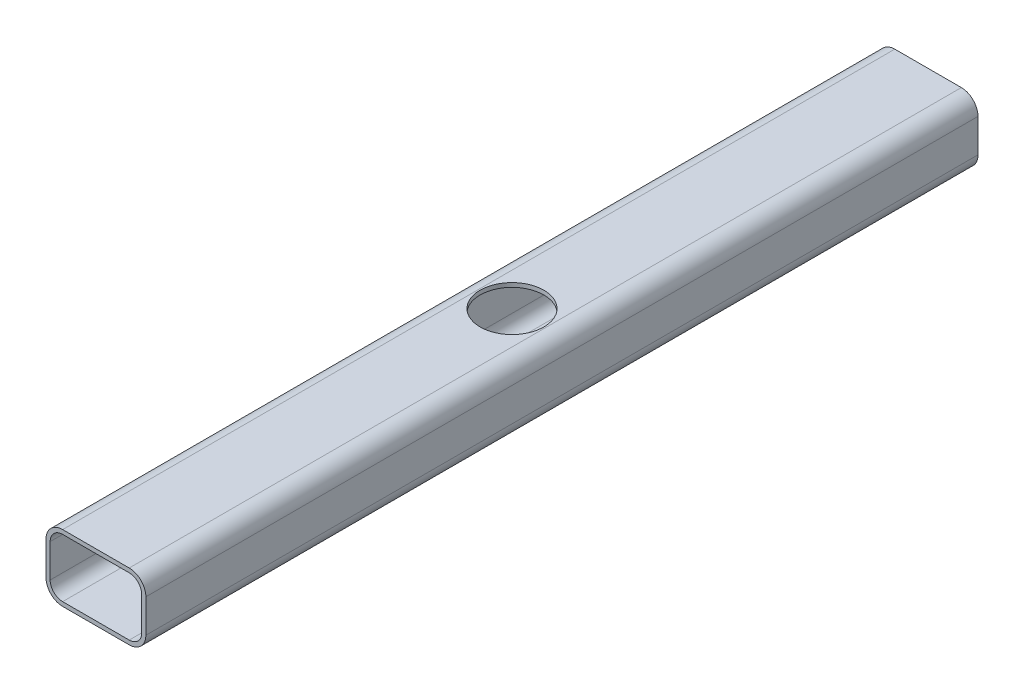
ISO-10303-21;
HEADER;
FILE_DESCRIPTION(('STEP AP214'),'2;1');
FILE_NAME('part.step','',(''),(''),'','','');
FILE_SCHEMA(('AUTOMOTIVE_DESIGN { 1 0 10303 214 1 1 1 1 }'));
ENDSEC;
DATA;
#1=APPLICATION_CONTEXT('core data for automotive mechanical design processes');
#2=APPLICATION_PROTOCOL_DEFINITION('international standard','automotive_design',2000,#1);
#3=PRODUCT_CONTEXT('',#1,'mechanical');
#4=PRODUCT('Part','Part','',(#3));
#5=PRODUCT_RELATED_PRODUCT_CATEGORY('part','',(#4));
#6=PRODUCT_DEFINITION_FORMATION('','',#4);
#7=PRODUCT_DEFINITION_CONTEXT('part definition',#1,'design');
#8=PRODUCT_DEFINITION('design','',#6,#7);
#9=PRODUCT_DEFINITION_SHAPE('','',#8);
#10=(LENGTH_UNIT() NAMED_UNIT(*) SI_UNIT(.MILLI.,.METRE.));
#11=(NAMED_UNIT(*) PLANE_ANGLE_UNIT() SI_UNIT($,.RADIAN.));
#12=(NAMED_UNIT(*) SI_UNIT($,.STERADIAN.) SOLID_ANGLE_UNIT());
#13=UNCERTAINTY_MEASURE_WITH_UNIT(LENGTH_MEASURE(1.E-05),#10,'distance_accuracy_value','');
#14=(GEOMETRIC_REPRESENTATION_CONTEXT(3) GLOBAL_UNCERTAINTY_ASSIGNED_CONTEXT((#13)) GLOBAL_UNIT_ASSIGNED_CONTEXT((#10,
#11,#12)) REPRESENTATION_CONTEXT('',''));
#15=CARTESIAN_POINT('',(0.,0.,0.));
#16=DIRECTION('',(0.,0.,1.));
#17=DIRECTION('',(1.,0.,0.));
#18=AXIS2_PLACEMENT_3D('',#15,#16,#17);
#19=CARTESIAN_POINT('',(25.3999999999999,-24.8599622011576,317.5));
#20=DIRECTION('',(0.,0.,1.));
#21=DIRECTION('',(1.,0.,0.));
#22=AXIS2_PLACEMENT_3D('',#19,#20,#21);
#23=PLANE('',#22);
#24=CARTESIAN_POINT('',(25.3999999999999,-24.8599622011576,317.5));
#25=DIRECTION('',(0.,0.,1.));
#26=DIRECTION('',(1.,0.,0.));
#27=AXIS2_PLACEMENT_3D('',#24,#25,#26);
#28=CIRCLE('',#27,12.7);
#29=CARTESIAN_POINT('',(25.3999999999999,-37.5599622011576,317.5));
#30=VERTEX_POINT('',#29);
#31=CARTESIAN_POINT('',(38.0999999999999,-24.8599622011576,317.5));
#32=VERTEX_POINT('',#31);
#33=EDGE_CURVE('E231',#30,#32,#28,.T.);
#34=ORIENTED_EDGE('',*,*,#33,.T.);
#35=DIRECTION('',(0.,-1.,0.));
#36=VECTOR('',#35,1.);
#37=CARTESIAN_POINT('',(38.0999999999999,0.540037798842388,317.5));
#38=LINE('',#37,#36);
#39=CARTESIAN_POINT('',(38.0999999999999,0.540037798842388,317.5));
#40=VERTEX_POINT('',#39);
#41=EDGE_CURVE('E233',#40,#32,#38,.T.);
#42=ORIENTED_EDGE('',*,*,#41,.F.);
#43=CARTESIAN_POINT('',(25.3999999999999,0.540037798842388,317.5));
#44=DIRECTION('',(0.,0.,1.));
#45=DIRECTION('',(1.,0.,0.));
#46=AXIS2_PLACEMENT_3D('',#43,#44,#45);
#47=CIRCLE('',#46,12.7);
#48=CARTESIAN_POINT('',(25.3999999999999,13.2400377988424,317.5));
#49=VERTEX_POINT('',#48);
#50=EDGE_CURVE('E236',#40,#49,#47,.T.);
#51=ORIENTED_EDGE('',*,*,#50,.T.);
#52=DIRECTION('',(-1.,0.,0.));
#53=VECTOR('',#52,1.);
#54=CARTESIAN_POINT('',(25.3999999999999,13.2400377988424,317.5));
#55=LINE('',#54,#53);
#56=CARTESIAN_POINT('',(-25.4000000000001,13.2400377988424,317.5));
#57=VERTEX_POINT('',#56);
#58=EDGE_CURVE('E238',#49,#57,#55,.T.);
#59=ORIENTED_EDGE('',*,*,#58,.T.);
#60=CARTESIAN_POINT('',(-25.4000000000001,0.540037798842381,317.5));
#61=DIRECTION('',(0.,0.,1.));
#62=DIRECTION('',(1.,0.,0.));
#63=AXIS2_PLACEMENT_3D('',#60,#61,#62);
#64=CIRCLE('',#63,12.7);
#65=CARTESIAN_POINT('',(-38.1000000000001,0.540037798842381,317.5));
#66=VERTEX_POINT('',#65);
#67=EDGE_CURVE('E240',#57,#66,#64,.T.);
#68=ORIENTED_EDGE('',*,*,#67,.T.);
#69=DIRECTION('',(0.,1.,0.));
#70=VECTOR('',#69,1.);
#71=CARTESIAN_POINT('',(-38.1000000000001,-24.8599622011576,317.5));
#72=LINE('',#71,#70);
#73=CARTESIAN_POINT('',(-38.1000000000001,-24.8599622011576,317.5));
#74=VERTEX_POINT('',#73);
#75=EDGE_CURVE('E242',#74,#66,#72,.T.);
#76=ORIENTED_EDGE('',*,*,#75,.F.);
#77=CARTESIAN_POINT('',(-25.4000000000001,-24.8599622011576,317.5));
#78=DIRECTION('',(0.,0.,1.));
#79=DIRECTION('',(1.,0.,0.));
#80=AXIS2_PLACEMENT_3D('',#77,#78,#79);
#81=CIRCLE('',#80,12.7);
#82=CARTESIAN_POINT('',(-25.4000000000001,-37.5599622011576,317.5));
#83=VERTEX_POINT('',#82);
#84=EDGE_CURVE('E245',#74,#83,#81,.T.);
#85=ORIENTED_EDGE('',*,*,#84,.T.);
#86=DIRECTION('',(1.,0.,0.));
#87=VECTOR('',#86,1.);
#88=CARTESIAN_POINT('',(-25.4000000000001,-37.5599622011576,317.5));
#89=LINE('',#88,#87);
#90=EDGE_CURVE('E247',#83,#30,#89,.T.);
#91=ORIENTED_EDGE('',*,*,#90,.T.);
#92=EDGE_LOOP('',(#34,#42,#51,#59,#68,#76,#85,#91));
#93=FACE_BOUND('',#92,.T.);
#94=DIRECTION('',(0.,-1.,0.));
#95=VECTOR('',#94,1.);
#96=CARTESIAN_POINT('',(34.9249999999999,0.540037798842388,317.5));
#97=LINE('',#96,#95);
#98=CARTESIAN_POINT('',(34.9249999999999,0.540037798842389,317.5));
#99=VERTEX_POINT('',#98);
#100=CARTESIAN_POINT('',(34.9249999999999,-24.8599622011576,317.5));
#101=VERTEX_POINT('',#100);
#102=EDGE_CURVE('E185',#99,#101,#97,.T.);
#103=ORIENTED_EDGE('',*,*,#102,.T.);
#104=CARTESIAN_POINT('',(25.3999999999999,-24.8599622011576,317.5));
#105=DIRECTION('',(0.,0.,1.));
#106=DIRECTION('',(1.,0.,0.));
#107=AXIS2_PLACEMENT_3D('',#104,#105,#106);
#108=CIRCLE('',#107,9.525);
#109=CARTESIAN_POINT('',(25.3999999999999,-34.3849622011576,317.5));
#110=VERTEX_POINT('',#109);
#111=EDGE_CURVE('E146',#110,#101,#108,.T.);
#112=ORIENTED_EDGE('',*,*,#111,.F.);
#113=DIRECTION('',(1.,0.,0.));
#114=VECTOR('',#113,1.);
#115=CARTESIAN_POINT('',(-25.4000000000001,-34.3849622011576,317.5));
#116=LINE('',#115,#114);
#117=CARTESIAN_POINT('',(-25.4000000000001,-34.3849622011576,317.5));
#118=VERTEX_POINT('',#117);
#119=EDGE_CURVE('E198',#118,#110,#116,.T.);
#120=ORIENTED_EDGE('',*,*,#119,.F.);
#121=CARTESIAN_POINT('',(-25.4000000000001,-24.8599622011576,317.5));
#122=DIRECTION('',(0.,0.,1.));
#123=DIRECTION('',(1.,0.,0.));
#124=AXIS2_PLACEMENT_3D('',#121,#122,#123);
#125=CIRCLE('',#124,9.525);
#126=CARTESIAN_POINT('',(-34.9250000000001,-24.8599622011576,317.5));
#127=VERTEX_POINT('',#126);
#128=EDGE_CURVE('E196',#127,#118,#125,.T.);
#129=ORIENTED_EDGE('',*,*,#128,.F.);
#130=DIRECTION('',(0.,1.,0.));
#131=VECTOR('',#130,1.);
#132=CARTESIAN_POINT('',(-34.9250000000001,-24.8599622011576,317.5));
#133=LINE('',#132,#131);
#134=CARTESIAN_POINT('',(-34.9250000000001,0.540037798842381,317.5));
#135=VERTEX_POINT('',#134);
#136=EDGE_CURVE('E193',#127,#135,#133,.T.);
#137=ORIENTED_EDGE('',*,*,#136,.T.);
#138=CARTESIAN_POINT('',(-25.4000000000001,0.540037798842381,317.5));
#139=DIRECTION('',(0.,0.,1.));
#140=DIRECTION('',(1.,0.,0.));
#141=AXIS2_PLACEMENT_3D('',#138,#139,#140);
#142=CIRCLE('',#141,9.525);
#143=CARTESIAN_POINT('',(-25.4000000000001,10.0650377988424,317.5));
#144=VERTEX_POINT('',#143);
#145=EDGE_CURVE('E191',#144,#135,#142,.T.);
#146=ORIENTED_EDGE('',*,*,#145,.F.);
#147=DIRECTION('',(-1.,0.,0.));
#148=VECTOR('',#147,1.);
#149=CARTESIAN_POINT('',(25.3999999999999,10.0650377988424,317.5));
#150=LINE('',#149,#148);
#151=CARTESIAN_POINT('',(25.3999999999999,10.0650377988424,317.5));
#152=VERTEX_POINT('',#151);
#153=EDGE_CURVE('E189',#152,#144,#150,.T.);
#154=ORIENTED_EDGE('',*,*,#153,.F.);
#155=CARTESIAN_POINT('',(25.3999999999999,0.540037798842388,317.5));
#156=DIRECTION('',(0.,0.,1.));
#157=DIRECTION('',(1.,0.,0.));
#158=AXIS2_PLACEMENT_3D('',#155,#156,#157);
#159=CIRCLE('',#158,9.525);
#160=EDGE_CURVE('E187',#99,#152,#159,.T.);
#161=ORIENTED_EDGE('',*,*,#160,.F.);
#162=EDGE_LOOP('',(#103,#112,#120,#129,#137,#146,#154,#161));
#163=FACE_BOUND('',#162,.T.);
#164=ADVANCED_FACE('F30',(#93,#163),#23,.T.);
#165=CARTESIAN_POINT('',(25.3999999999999,-24.8599622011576,-317.5));
#166=DIRECTION('',(0.,0.,1.));
#167=DIRECTION('',(1.,0.,0.));
#168=AXIS2_PLACEMENT_3D('',#165,#166,#167);
#169=PLANE('',#168);
#170=CARTESIAN_POINT('',(25.3999999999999,-24.8599622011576,-317.5));
#171=DIRECTION('',(0.,0.,1.));
#172=DIRECTION('',(1.,0.,0.));
#173=AXIS2_PLACEMENT_3D('',#170,#171,#172);
#174=CIRCLE('',#173,12.7);
#175=CARTESIAN_POINT('',(25.3999999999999,-37.5599622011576,-317.5));
#176=VERTEX_POINT('',#175);
#177=CARTESIAN_POINT('',(38.0999999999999,-24.8599622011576,-317.5));
#178=VERTEX_POINT('',#177);
#179=EDGE_CURVE('E150',#176,#178,#174,.T.);
#180=ORIENTED_EDGE('',*,*,#179,.F.);
#181=DIRECTION('',(1.,0.,0.));
#182=VECTOR('',#181,1.);
#183=CARTESIAN_POINT('',(-25.4000000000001,-37.5599622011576,-317.5));
#184=LINE('',#183,#182);
#185=CARTESIAN_POINT('',(-25.4000000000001,-37.5599622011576,-317.5));
#186=VERTEX_POINT('',#185);
#187=EDGE_CURVE('E229',#186,#176,#184,.T.);
#188=ORIENTED_EDGE('',*,*,#187,.F.);
#189=CARTESIAN_POINT('',(-25.4000000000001,-24.8599622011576,-317.5));
#190=DIRECTION('',(0.,0.,1.));
#191=DIRECTION('',(1.,0.,0.));
#192=AXIS2_PLACEMENT_3D('',#189,#190,#191);
#193=CIRCLE('',#192,12.7);
#194=CARTESIAN_POINT('',(-38.1000000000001,-24.8599622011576,-317.5));
#195=VERTEX_POINT('',#194);
#196=EDGE_CURVE('E227',#195,#186,#193,.T.);
#197=ORIENTED_EDGE('',*,*,#196,.F.);
#198=DIRECTION('',(0.,1.,0.));
#199=VECTOR('',#198,1.);
#200=CARTESIAN_POINT('',(-38.1000000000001,-24.8599622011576,-317.5));
#201=LINE('',#200,#199);
#202=CARTESIAN_POINT('',(-38.1000000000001,0.540037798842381,-317.5));
#203=VERTEX_POINT('',#202);
#204=EDGE_CURVE('E224',#195,#203,#201,.T.);
#205=ORIENTED_EDGE('',*,*,#204,.T.);
#206=CARTESIAN_POINT('',(-25.4000000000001,0.540037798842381,-317.5));
#207=DIRECTION('',(0.,0.,1.));
#208=DIRECTION('',(1.,0.,0.));
#209=AXIS2_PLACEMENT_3D('',#206,#207,#208);
#210=CIRCLE('',#209,12.7);
#211=CARTESIAN_POINT('',(-25.4000000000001,13.2400377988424,-317.5));
#212=VERTEX_POINT('',#211);
#213=EDGE_CURVE('E221',#212,#203,#210,.T.);
#214=ORIENTED_EDGE('',*,*,#213,.F.);
#215=DIRECTION('',(-1.,0.,0.));
#216=VECTOR('',#215,1.);
#217=CARTESIAN_POINT('',(25.3999999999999,13.2400377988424,-317.5));
#218=LINE('',#217,#216);
#219=CARTESIAN_POINT('',(25.3999999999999,13.2400377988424,-317.5));
#220=VERTEX_POINT('',#219);
#221=EDGE_CURVE('E219',#220,#212,#218,.T.);
#222=ORIENTED_EDGE('',*,*,#221,.F.);
#223=CARTESIAN_POINT('',(25.3999999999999,0.540037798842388,-317.5));
#224=DIRECTION('',(0.,0.,1.));
#225=DIRECTION('',(1.,0.,0.));
#226=AXIS2_PLACEMENT_3D('',#223,#224,#225);
#227=CIRCLE('',#226,12.7);
#228=CARTESIAN_POINT('',(38.0999999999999,0.540037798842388,-317.5));
#229=VERTEX_POINT('',#228);
#230=EDGE_CURVE('E217',#229,#220,#227,.T.);
#231=ORIENTED_EDGE('',*,*,#230,.F.);
#232=DIRECTION('',(0.,-1.,0.));
#233=VECTOR('',#232,1.);
#234=CARTESIAN_POINT('',(38.0999999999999,0.540037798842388,-317.5));
#235=LINE('',#234,#233);
#236=EDGE_CURVE('E214',#229,#178,#235,.T.);
#237=ORIENTED_EDGE('',*,*,#236,.T.);
#238=EDGE_LOOP('',(#180,#188,#197,#205,#214,#222,#231,#237));
#239=FACE_BOUND('',#238,.T.);
#240=CARTESIAN_POINT('',(25.3999999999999,-24.8599622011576,-317.5));
#241=DIRECTION('',(0.,0.,1.));
#242=DIRECTION('',(1.,0.,0.));
#243=AXIS2_PLACEMENT_3D('',#240,#241,#242);
#244=CIRCLE('',#243,9.525);
#245=CARTESIAN_POINT('',(25.3999999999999,-34.3849622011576,-317.5));
#246=VERTEX_POINT('',#245);
#247=CARTESIAN_POINT('',(34.9249999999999,-24.8599622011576,-317.5));
#248=VERTEX_POINT('',#247);
#249=EDGE_CURVE('E54',#246,#248,#244,.T.);
#250=ORIENTED_EDGE('',*,*,#249,.T.);
#251=DIRECTION('',(0.,-1.,0.));
#252=VECTOR('',#251,1.);
#253=CARTESIAN_POINT('',(34.9249999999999,0.540037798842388,-317.5));
#254=LINE('',#253,#252);
#255=CARTESIAN_POINT('',(34.9249999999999,0.540037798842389,-317.5));
#256=VERTEX_POINT('',#255);
#257=EDGE_CURVE('E154',#256,#248,#254,.T.);
#258=ORIENTED_EDGE('',*,*,#257,.F.);
#259=CARTESIAN_POINT('',(25.3999999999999,0.540037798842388,-317.5));
#260=DIRECTION('',(0.,0.,1.));
#261=DIRECTION('',(1.,0.,0.));
#262=AXIS2_PLACEMENT_3D('',#259,#260,#261);
#263=CIRCLE('',#262,9.525);
#264=CARTESIAN_POINT('',(25.3999999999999,10.0650377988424,-317.5));
#265=VERTEX_POINT('',#264);
#266=EDGE_CURVE('E159',#256,#265,#263,.T.);
#267=ORIENTED_EDGE('',*,*,#266,.T.);
#268=DIRECTION('',(-1.,0.,0.));
#269=VECTOR('',#268,1.);
#270=CARTESIAN_POINT('',(25.3999999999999,10.0650377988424,-317.5));
#271=LINE('',#270,#269);
#272=CARTESIAN_POINT('',(-25.4000000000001,10.0650377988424,-317.5));
#273=VERTEX_POINT('',#272);
#274=EDGE_CURVE('E172',#265,#273,#271,.T.);
#275=ORIENTED_EDGE('',*,*,#274,.T.);
#276=CARTESIAN_POINT('',(-25.4000000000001,0.540037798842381,-317.5));
#277=DIRECTION('',(0.,0.,1.));
#278=DIRECTION('',(1.,0.,0.));
#279=AXIS2_PLACEMENT_3D('',#276,#277,#278);
#280=CIRCLE('',#279,9.525);
#281=CARTESIAN_POINT('',(-34.9250000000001,0.540037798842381,-317.5));
#282=VERTEX_POINT('',#281);
#283=EDGE_CURVE('E175',#273,#282,#280,.T.);
#284=ORIENTED_EDGE('',*,*,#283,.T.);
#285=DIRECTION('',(0.,1.,0.));
#286=VECTOR('',#285,1.);
#287=CARTESIAN_POINT('',(-34.9250000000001,-24.8599622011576,-317.5));
#288=LINE('',#287,#286);
#289=CARTESIAN_POINT('',(-34.9250000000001,-24.8599622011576,-317.5));
#290=VERTEX_POINT('',#289);
#291=EDGE_CURVE('E178',#290,#282,#288,.T.);
#292=ORIENTED_EDGE('',*,*,#291,.F.);
#293=CARTESIAN_POINT('',(-25.4000000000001,-24.8599622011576,-317.5));
#294=DIRECTION('',(0.,0.,1.));
#295=DIRECTION('',(1.,0.,0.));
#296=AXIS2_PLACEMENT_3D('',#293,#294,#295);
#297=CIRCLE('',#296,9.525);
#298=CARTESIAN_POINT('',(-25.4000000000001,-34.3849622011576,-317.5));
#299=VERTEX_POINT('',#298);
#300=EDGE_CURVE('E181',#290,#299,#297,.T.);
#301=ORIENTED_EDGE('',*,*,#300,.T.);
#302=DIRECTION('',(1.,0.,0.));
#303=VECTOR('',#302,1.);
#304=CARTESIAN_POINT('',(-25.4000000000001,-34.3849622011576,-317.5));
#305=LINE('',#304,#303);
#306=EDGE_CURVE('E164',#299,#246,#305,.T.);
#307=ORIENTED_EDGE('',*,*,#306,.T.);
#308=EDGE_LOOP('',(#250,#258,#267,#275,#284,#292,#301,#307));
#309=FACE_BOUND('',#308,.T.);
#310=ADVANCED_FACE('F162',(#239,#309),#169,.F.);
#311=CARTESIAN_POINT('',(25.3999999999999,-24.8599622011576,317.5));
#312=DIRECTION('',(0.,0.,-1.));
#313=DIRECTION('',(-1.,0.,0.));
#314=AXIS2_PLACEMENT_3D('',#311,#312,#313);
#315=CYLINDRICAL_SURFACE('',#314,12.7);
#316=ORIENTED_EDGE('',*,*,#179,.T.);
#317=DIRECTION('',(0.,0.,-1.));
#318=VECTOR('',#317,1.);
#319=CARTESIAN_POINT('',(38.0999999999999,-24.8599622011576,317.5));
#320=LINE('',#319,#318);
#321=EDGE_CURVE('E11',#32,#178,#320,.T.);
#322=ORIENTED_EDGE('',*,*,#321,.F.);
#323=ORIENTED_EDGE('',*,*,#33,.F.);
#324=DIRECTION('',(0.,0.,-1.));
#325=VECTOR('',#324,1.);
#326=CARTESIAN_POINT('',(25.3999999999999,-37.5599622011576,317.5));
#327=LINE('',#326,#325);
#328=EDGE_CURVE('E249',#30,#176,#327,.T.);
#329=ORIENTED_EDGE('',*,*,#328,.T.);
#330=EDGE_LOOP('',(#316,#322,#323,#329));
#331=FACE_BOUND('',#330,.T.);
#332=ADVANCED_FACE('F32',(#331),#315,.T.);
#333=CARTESIAN_POINT('',(38.0999999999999,0.540037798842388,317.5));
#334=DIRECTION('',(1.,0.,0.));
#335=DIRECTION('',(0.,0.,-1.));
#336=AXIS2_PLACEMENT_3D('',#333,#334,#335);
#337=PLANE('',#336);
#338=ORIENTED_EDGE('',*,*,#236,.F.);
#339=DIRECTION('',(0.,0.,-1.));
#340=VECTOR('',#339,1.);
#341=CARTESIAN_POINT('',(38.0999999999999,0.540037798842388,317.5));
#342=LINE('',#341,#340);
#343=EDGE_CURVE('E39',#40,#229,#342,.T.);
#344=ORIENTED_EDGE('',*,*,#343,.F.);
#345=ORIENTED_EDGE('',*,*,#41,.T.);
#346=ORIENTED_EDGE('',*,*,#321,.T.);
#347=EDGE_LOOP('',(#338,#344,#345,#346));
#348=FACE_BOUND('',#347,.T.);
#349=ADVANCED_FACE('F277',(#348),#337,.T.);
#350=CARTESIAN_POINT('',(25.3999999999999,0.540037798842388,317.5));
#351=DIRECTION('',(0.,0.,-1.));
#352=DIRECTION('',(-1.,0.,0.));
#353=AXIS2_PLACEMENT_3D('',#350,#351,#352);
#354=CYLINDRICAL_SURFACE('',#353,12.7);
#355=ORIENTED_EDGE('',*,*,#230,.T.);
#356=DIRECTION('',(0.,0.,-1.));
#357=VECTOR('',#356,1.);
#358=CARTESIAN_POINT('',(25.3999999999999,13.2400377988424,317.5));
#359=LINE('',#358,#357);
#360=EDGE_CURVE('E262',#49,#220,#359,.T.);
#361=ORIENTED_EDGE('',*,*,#360,.F.);
#362=ORIENTED_EDGE('',*,*,#50,.F.);
#363=ORIENTED_EDGE('',*,*,#343,.T.);
#364=EDGE_LOOP('',(#355,#361,#362,#363));
#365=FACE_BOUND('',#364,.T.);
#366=ADVANCED_FACE('F268',(#365),#354,.T.);
#367=CARTESIAN_POINT('',(25.3999999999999,13.2400377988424,317.5));
#368=DIRECTION('',(0.,-1.,0.));
#369=DIRECTION('',(1.,0.,0.));
#370=AXIS2_PLACEMENT_3D('',#367,#368,#369);
#371=PLANE('',#370);
#372=CARTESIAN_POINT('',(0.,13.2400377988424,0.));
#373=DIRECTION('',(0.,1.,0.));
#374=DIRECTION('',(-1.,0.,0.));
#375=AXIS2_PLACEMENT_3D('',#372,#373,#374);
#376=CIRCLE('',#375,24.3219009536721);
#377=CARTESIAN_POINT('',(-24.3219009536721,13.2400377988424,0.));
#378=VERTEX_POINT('',#377);
#379=EDGE_CURVE('E486',#378,#378,#376,.T.);
#380=ORIENTED_EDGE('',*,*,#379,.F.);
#381=EDGE_LOOP('',(#380));
#382=FACE_BOUND('',#381,.T.);
#383=ORIENTED_EDGE('',*,*,#221,.T.);
#384=DIRECTION('',(0.,0.,-1.));
#385=VECTOR('',#384,1.);
#386=CARTESIAN_POINT('',(-25.4000000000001,13.2400377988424,317.5));
#387=LINE('',#386,#385);
#388=EDGE_CURVE('E259',#57,#212,#387,.T.);
#389=ORIENTED_EDGE('',*,*,#388,.F.);
#390=ORIENTED_EDGE('',*,*,#58,.F.);
#391=ORIENTED_EDGE('',*,*,#360,.T.);
#392=EDGE_LOOP('',(#383,#389,#390,#391));
#393=FACE_BOUND('',#392,.T.);
#394=ADVANCED_FACE('F302',(#382,#393),#371,.F.);
#395=CARTESIAN_POINT('',(-25.4000000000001,0.540037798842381,317.5));
#396=DIRECTION('',(0.,0.,-1.));
#397=DIRECTION('',(-1.,0.,0.));
#398=AXIS2_PLACEMENT_3D('',#395,#396,#397);
#399=CYLINDRICAL_SURFACE('',#398,12.7);
#400=ORIENTED_EDGE('',*,*,#213,.T.);
#401=DIRECTION('',(0.,0.,-1.));
#402=VECTOR('',#401,1.);
#403=CARTESIAN_POINT('',(-38.1000000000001,0.540037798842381,317.5));
#404=LINE('',#403,#402);
#405=EDGE_CURVE('E257',#66,#203,#404,.T.);
#406=ORIENTED_EDGE('',*,*,#405,.F.);
#407=ORIENTED_EDGE('',*,*,#67,.F.);
#408=ORIENTED_EDGE('',*,*,#388,.T.);
#409=EDGE_LOOP('',(#400,#406,#407,#408));
#410=FACE_BOUND('',#409,.T.);
#411=ADVANCED_FACE('F297',(#410),#399,.T.);
#412=CARTESIAN_POINT('',(-38.1000000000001,-24.8599622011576,317.5));
#413=DIRECTION('',(-1.,0.,0.));
#414=DIRECTION('',(0.,0.,1.));
#415=AXIS2_PLACEMENT_3D('',#412,#413,#414);
#416=PLANE('',#415);
#417=ORIENTED_EDGE('',*,*,#204,.F.);
#418=DIRECTION('',(0.,0.,-1.));
#419=VECTOR('',#418,1.);
#420=CARTESIAN_POINT('',(-38.1000000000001,-24.8599622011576,317.5));
#421=LINE('',#420,#419);
#422=EDGE_CURVE('E255',#74,#195,#421,.T.);
#423=ORIENTED_EDGE('',*,*,#422,.F.);
#424=ORIENTED_EDGE('',*,*,#75,.T.);
#425=ORIENTED_EDGE('',*,*,#405,.T.);
#426=EDGE_LOOP('',(#417,#423,#424,#425));
#427=FACE_BOUND('',#426,.T.);
#428=ADVANCED_FACE('F294',(#427),#416,.T.);
#429=CARTESIAN_POINT('',(-25.4000000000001,-24.8599622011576,317.5));
#430=DIRECTION('',(0.,0.,-1.));
#431=DIRECTION('',(-1.,0.,0.));
#432=AXIS2_PLACEMENT_3D('',#429,#430,#431);
#433=CYLINDRICAL_SURFACE('',#432,12.7);
#434=ORIENTED_EDGE('',*,*,#196,.T.);
#435=DIRECTION('',(0.,0.,-1.));
#436=VECTOR('',#435,1.);
#437=CARTESIAN_POINT('',(-25.4000000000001,-37.5599622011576,317.5));
#438=LINE('',#437,#436);
#439=EDGE_CURVE('E252',#83,#186,#438,.T.);
#440=ORIENTED_EDGE('',*,*,#439,.F.);
#441=ORIENTED_EDGE('',*,*,#84,.F.);
#442=ORIENTED_EDGE('',*,*,#422,.T.);
#443=EDGE_LOOP('',(#434,#440,#441,#442));
#444=FACE_BOUND('',#443,.T.);
#445=ADVANCED_FACE('F291',(#444),#433,.T.);
#446=CARTESIAN_POINT('',(-25.4000000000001,-37.5599622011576,317.5));
#447=DIRECTION('',(0.,1.,0.));
#448=DIRECTION('',(-1.,0.,0.));
#449=AXIS2_PLACEMENT_3D('',#446,#447,#448);
#450=PLANE('',#449);
#451=CARTESIAN_POINT('',(0.,-37.5599622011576,0.));
#452=DIRECTION('',(0.,1.,0.));
#453=DIRECTION('',(-1.,0.,0.));
#454=AXIS2_PLACEMENT_3D('',#451,#452,#453);
#455=CIRCLE('',#454,24.3219009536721);
#456=CARTESIAN_POINT('',(-24.3219009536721,-37.5599622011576,0.));
#457=VERTEX_POINT('',#456);
#458=EDGE_CURVE('E487',#457,#457,#455,.T.);
#459=ORIENTED_EDGE('',*,*,#458,.T.);
#460=EDGE_LOOP('',(#459));
#461=FACE_BOUND('',#460,.T.);
#462=ORIENTED_EDGE('',*,*,#187,.T.);
#463=ORIENTED_EDGE('',*,*,#328,.F.);
#464=ORIENTED_EDGE('',*,*,#90,.F.);
#465=ORIENTED_EDGE('',*,*,#439,.T.);
#466=EDGE_LOOP('',(#462,#463,#464,#465));
#467=FACE_BOUND('',#466,.T.);
#468=ADVANCED_FACE('F286',(#461,#467),#450,.F.);
#469=CARTESIAN_POINT('',(25.3999999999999,-24.8599622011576,317.5));
#470=DIRECTION('',(0.,0.,-1.));
#471=DIRECTION('',(-1.,0.,0.));
#472=AXIS2_PLACEMENT_3D('',#469,#470,#471);
#473=CYLINDRICAL_SURFACE('',#472,9.525);
#474=ORIENTED_EDGE('',*,*,#249,.F.);
#475=DIRECTION('',(0.,0.,-1.));
#476=VECTOR('',#475,1.);
#477=CARTESIAN_POINT('',(25.3999999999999,-34.3849622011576,317.5));
#478=LINE('',#477,#476);
#479=EDGE_CURVE('E200',#110,#246,#478,.T.);
#480=ORIENTED_EDGE('',*,*,#479,.F.);
#481=ORIENTED_EDGE('',*,*,#111,.T.);
#482=DIRECTION('',(0.,0.,-1.));
#483=VECTOR('',#482,1.);
#484=CARTESIAN_POINT('',(34.9249999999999,-24.8599622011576,317.5));
#485=LINE('',#484,#483);
#486=EDGE_CURVE('E142',#101,#248,#485,.T.);
#487=ORIENTED_EDGE('',*,*,#486,.T.);
#488=EDGE_LOOP('',(#474,#480,#481,#487));
#489=FACE_BOUND('',#488,.T.);
#490=ADVANCED_FACE('F144',(#489),#473,.F.);
#491=CARTESIAN_POINT('',(34.9249999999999,0.540037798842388,317.5));
#492=DIRECTION('',(1.,0.,0.));
#493=DIRECTION('',(0.,0.,-1.));
#494=AXIS2_PLACEMENT_3D('',#491,#492,#493);
#495=PLANE('',#494);
#496=ORIENTED_EDGE('',*,*,#257,.T.);
#497=ORIENTED_EDGE('',*,*,#486,.F.);
#498=ORIENTED_EDGE('',*,*,#102,.F.);
#499=DIRECTION('',(0.,0.,-1.));
#500=VECTOR('',#499,1.);
#501=CARTESIAN_POINT('',(34.9249999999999,0.540037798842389,317.5));
#502=LINE('',#501,#500);
#503=EDGE_CURVE('E151',#99,#256,#502,.T.);
#504=ORIENTED_EDGE('',*,*,#503,.T.);
#505=EDGE_LOOP('',(#496,#497,#498,#504));
#506=FACE_BOUND('',#505,.T.);
#507=ADVANCED_FACE('F155',(#506),#495,.F.);
#508=CARTESIAN_POINT('',(25.3999999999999,0.540037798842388,317.5));
#509=DIRECTION('',(0.,0.,-1.));
#510=DIRECTION('',(-1.,0.,0.));
#511=AXIS2_PLACEMENT_3D('',#508,#509,#510);
#512=CYLINDRICAL_SURFACE('',#511,9.525);
#513=ORIENTED_EDGE('',*,*,#266,.F.);
#514=ORIENTED_EDGE('',*,*,#503,.F.);
#515=ORIENTED_EDGE('',*,*,#160,.T.);
#516=DIRECTION('',(0.,0.,-1.));
#517=VECTOR('',#516,1.);
#518=CARTESIAN_POINT('',(25.3999999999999,10.0650377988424,317.5));
#519=LINE('',#518,#517);
#520=EDGE_CURVE('E209',#152,#265,#519,.T.);
#521=ORIENTED_EDGE('',*,*,#520,.T.);
#522=EDGE_LOOP('',(#513,#514,#515,#521));
#523=FACE_BOUND('',#522,.T.);
#524=ADVANCED_FACE('F313',(#523),#512,.F.);
#525=CARTESIAN_POINT('',(25.3999999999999,10.0650377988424,317.5));
#526=DIRECTION('',(0.,-1.,0.));
#527=DIRECTION('',(1.,0.,0.));
#528=AXIS2_PLACEMENT_3D('',#525,#526,#527);
#529=PLANE('',#528);
#530=CARTESIAN_POINT('',(0.,10.0650377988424,0.));
#531=DIRECTION('',(0.,-1.,0.));
#532=DIRECTION('',(1.,0.,0.));
#533=AXIS2_PLACEMENT_3D('',#530,#531,#532);
#534=CIRCLE('',#533,24.3219009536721);
#535=CARTESIAN_POINT('',(24.3219009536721,10.0650377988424,0.));
#536=VERTEX_POINT('',#535);
#537=EDGE_CURVE('E165',#536,#536,#534,.T.);
#538=ORIENTED_EDGE('',*,*,#537,.F.);
#539=EDGE_LOOP('',(#538));
#540=FACE_BOUND('',#539,.T.);
#541=ORIENTED_EDGE('',*,*,#274,.F.);
#542=ORIENTED_EDGE('',*,*,#520,.F.);
#543=ORIENTED_EDGE('',*,*,#153,.T.);
#544=DIRECTION('',(0.,0.,-1.));
#545=VECTOR('',#544,1.);
#546=CARTESIAN_POINT('',(-25.4000000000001,10.0650377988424,317.5));
#547=LINE('',#546,#545);
#548=EDGE_CURVE('E207',#144,#273,#547,.T.);
#549=ORIENTED_EDGE('',*,*,#548,.T.);
#550=EDGE_LOOP('',(#541,#542,#543,#549));
#551=FACE_BOUND('',#550,.T.);
#552=ADVANCED_FACE('F316',(#540,#551),#529,.T.);
#553=CARTESIAN_POINT('',(-25.4000000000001,0.540037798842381,317.5));
#554=DIRECTION('',(0.,0.,-1.));
#555=DIRECTION('',(-1.,0.,0.));
#556=AXIS2_PLACEMENT_3D('',#553,#554,#555);
#557=CYLINDRICAL_SURFACE('',#556,9.525);
#558=ORIENTED_EDGE('',*,*,#283,.F.);
#559=ORIENTED_EDGE('',*,*,#548,.F.);
#560=ORIENTED_EDGE('',*,*,#145,.T.);
#561=DIRECTION('',(0.,0.,-1.));
#562=VECTOR('',#561,1.);
#563=CARTESIAN_POINT('',(-34.9250000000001,0.540037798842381,317.5));
#564=LINE('',#563,#562);
#565=EDGE_CURVE('E205',#135,#282,#564,.T.);
#566=ORIENTED_EDGE('',*,*,#565,.T.);
#567=EDGE_LOOP('',(#558,#559,#560,#566));
#568=FACE_BOUND('',#567,.T.);
#569=ADVANCED_FACE('F321',(#568),#557,.F.);
#570=CARTESIAN_POINT('',(-34.9250000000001,-24.8599622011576,317.5));
#571=DIRECTION('',(-1.,0.,0.));
#572=DIRECTION('',(0.,0.,1.));
#573=AXIS2_PLACEMENT_3D('',#570,#571,#572);
#574=PLANE('',#573);
#575=ORIENTED_EDGE('',*,*,#291,.T.);
#576=ORIENTED_EDGE('',*,*,#565,.F.);
#577=ORIENTED_EDGE('',*,*,#136,.F.);
#578=DIRECTION('',(0.,0.,-1.));
#579=VECTOR('',#578,1.);
#580=CARTESIAN_POINT('',(-34.9250000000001,-24.8599622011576,317.5));
#581=LINE('',#580,#579);
#582=EDGE_CURVE('E203',#127,#290,#581,.T.);
#583=ORIENTED_EDGE('',*,*,#582,.T.);
#584=EDGE_LOOP('',(#575,#576,#577,#583));
#585=FACE_BOUND('',#584,.T.);
#586=ADVANCED_FACE('F325',(#585),#574,.F.);
#587=CARTESIAN_POINT('',(-25.4000000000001,-24.8599622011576,317.5));
#588=DIRECTION('',(0.,0.,-1.));
#589=DIRECTION('',(-1.,0.,0.));
#590=AXIS2_PLACEMENT_3D('',#587,#588,#589);
#591=CYLINDRICAL_SURFACE('',#590,9.525);
#592=ORIENTED_EDGE('',*,*,#300,.F.);
#593=ORIENTED_EDGE('',*,*,#582,.F.);
#594=ORIENTED_EDGE('',*,*,#128,.T.);
#595=DIRECTION('',(0.,0.,-1.));
#596=VECTOR('',#595,1.);
#597=CARTESIAN_POINT('',(-25.4000000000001,-34.3849622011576,317.5));
#598=LINE('',#597,#596);
#599=EDGE_CURVE('E46',#118,#299,#598,.T.);
#600=ORIENTED_EDGE('',*,*,#599,.T.);
#601=EDGE_LOOP('',(#592,#593,#594,#600));
#602=FACE_BOUND('',#601,.T.);
#603=ADVANCED_FACE('F329',(#602),#591,.F.);
#604=CARTESIAN_POINT('',(-25.4000000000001,-34.3849622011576,317.5));
#605=DIRECTION('',(0.,1.,0.));
#606=DIRECTION('',(-1.,0.,0.));
#607=AXIS2_PLACEMENT_3D('',#604,#605,#606);
#608=PLANE('',#607);
#609=CARTESIAN_POINT('',(0.,-34.3849622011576,0.));
#610=DIRECTION('',(0.,1.,0.));
#611=DIRECTION('',(-1.,0.,0.));
#612=AXIS2_PLACEMENT_3D('',#609,#610,#611);
#613=CIRCLE('',#612,24.3219009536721);
#614=CARTESIAN_POINT('',(-24.3219009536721,-34.3849622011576,0.));
#615=VERTEX_POINT('',#614);
#616=EDGE_CURVE('E34',#615,#615,#613,.T.);
#617=ORIENTED_EDGE('',*,*,#616,.F.);
#618=EDGE_LOOP('',(#617));
#619=FACE_BOUND('',#618,.T.);
#620=ORIENTED_EDGE('',*,*,#306,.F.);
#621=ORIENTED_EDGE('',*,*,#599,.F.);
#622=ORIENTED_EDGE('',*,*,#119,.T.);
#623=ORIENTED_EDGE('',*,*,#479,.T.);
#624=EDGE_LOOP('',(#620,#621,#622,#623));
#625=FACE_BOUND('',#624,.T.);
#626=ADVANCED_FACE('F330',(#619,#625),#608,.T.);
#627=CARTESIAN_POINT('',(0.,-37.5599622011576,0.));
#628=DIRECTION('',(0.,1.,0.));
#629=DIRECTION('',(-1.,0.,0.));
#630=AXIS2_PLACEMENT_3D('',#627,#628,#629);
#631=CYLINDRICAL_SURFACE('',#630,24.3219009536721);
#632=ORIENTED_EDGE('',*,*,#616,.T.);
#633=EDGE_LOOP('',(#632));
#634=FACE_BOUND('',#633,.T.);
#635=ORIENTED_EDGE('',*,*,#458,.F.);
#636=EDGE_LOOP('',(#635));
#637=FACE_BOUND('',#636,.T.);
#638=ADVANCED_FACE('F332',(#634,#637),#631,.F.);
#639=ORIENTED_EDGE('',*,*,#537,.T.);
#640=EDGE_LOOP('',(#639));
#641=FACE_BOUND('',#640,.T.);
#642=ORIENTED_EDGE('',*,*,#379,.T.);
#643=EDGE_LOOP('',(#642));
#644=FACE_BOUND('',#643,.T.);
#645=ADVANCED_FACE('F339',(#641,#644),#631,.F.);
#646=CLOSED_SHELL('',(#164,#310,#332,#349,#366,#394,#411,#428,#445,#468,#490,#507,#524,#552,
#569,#586,#603,#626,#638,#645));
#647=MANIFOLD_SOLID_BREP('B2',#646);
#648=ADVANCED_BREP_SHAPE_REPRESENTATION('',(#18,#647),#14);
#649=SHAPE_DEFINITION_REPRESENTATION(#9,#648);
ENDSEC;
END-ISO-10303-21;
